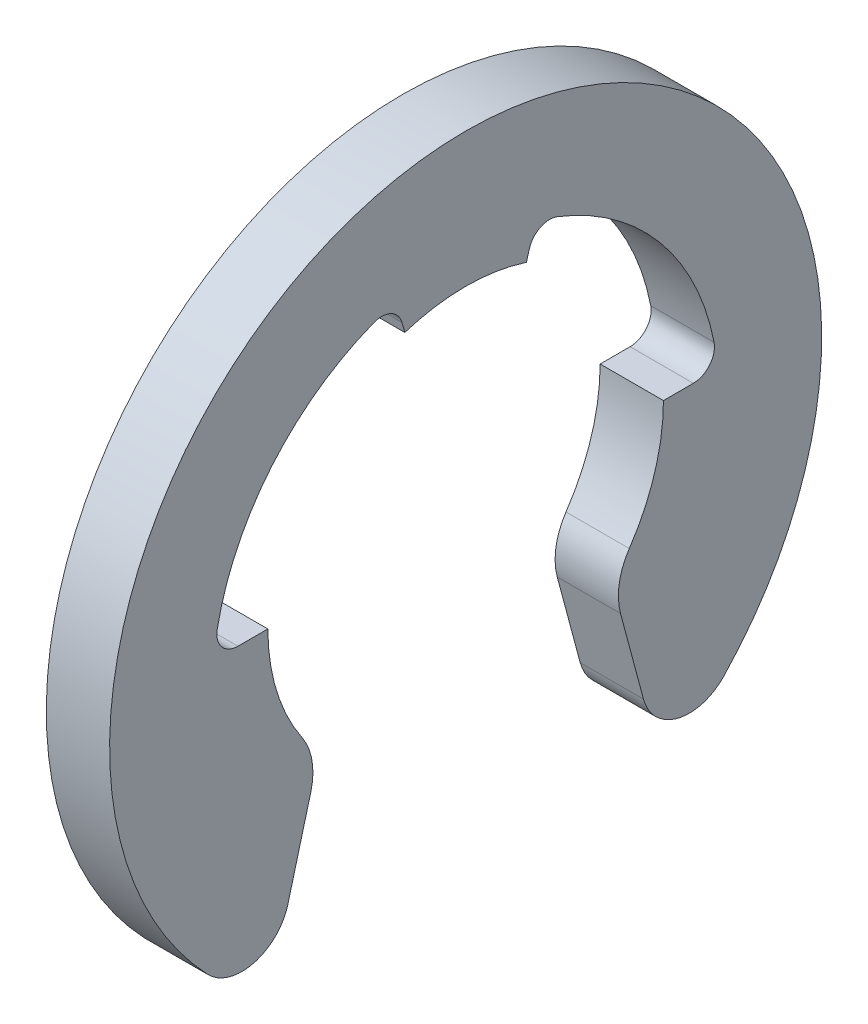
ISO-10303-21;
HEADER;
FILE_DESCRIPTION(('STEP AP214'),'2;1');
FILE_NAME('part.step','',(''),(''),'','','');
FILE_SCHEMA(('AUTOMOTIVE_DESIGN { 1 0 10303 214 1 1 1 1 }'));
ENDSEC;
DATA;
#1=APPLICATION_CONTEXT('core data for automotive mechanical design processes');
#2=APPLICATION_PROTOCOL_DEFINITION('international standard','automotive_design',2000,#1);
#3=PRODUCT_CONTEXT('',#1,'mechanical');
#4=PRODUCT('Part','Part','',(#3));
#5=PRODUCT_RELATED_PRODUCT_CATEGORY('part','',(#4));
#6=PRODUCT_DEFINITION_FORMATION('','',#4);
#7=PRODUCT_DEFINITION_CONTEXT('part definition',#1,'design');
#8=PRODUCT_DEFINITION('design','',#6,#7);
#9=PRODUCT_DEFINITION_SHAPE('','',#8);
#10=(LENGTH_UNIT() NAMED_UNIT(*) SI_UNIT(.MILLI.,.METRE.));
#11=(NAMED_UNIT(*) PLANE_ANGLE_UNIT() SI_UNIT($,.RADIAN.));
#12=(NAMED_UNIT(*) SI_UNIT($,.STERADIAN.) SOLID_ANGLE_UNIT());
#13=UNCERTAINTY_MEASURE_WITH_UNIT(LENGTH_MEASURE(1.E-05),#10,'distance_accuracy_value','');
#14=(GEOMETRIC_REPRESENTATION_CONTEXT(3) GLOBAL_UNCERTAINTY_ASSIGNED_CONTEXT((#13)) GLOBAL_UNIT_ASSIGNED_CONTEXT((#10,
#11,#12)) REPRESENTATION_CONTEXT('',''));
#15=CARTESIAN_POINT('',(0.,0.,0.));
#16=DIRECTION('',(0.,0.,1.));
#17=DIRECTION('',(1.,0.,0.));
#18=AXIS2_PLACEMENT_3D('',#15,#16,#17);
#19=CARTESIAN_POINT('',(0.4,0.283333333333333,-1.43903903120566));
#20=DIRECTION('',(-1.,0.,0.));
#21=DIRECTION('',(0.,0.,1.));
#22=AXIS2_PLACEMENT_3D('',#19,#20,#21);
#23=CYLINDRICAL_SURFACE('',#22,0.133333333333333);
#24=CARTESIAN_POINT('',(0.,0.283333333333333,-1.43903903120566));
#25=DIRECTION('',(-1.,0.,0.));
#26=DIRECTION('',(0.,0.,1.));
#27=AXIS2_PLACEMENT_3D('',#24,#25,#26);
#28=CIRCLE('',#27,0.133333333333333);
#29=CARTESIAN_POINT('',(0.,0.309090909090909,-1.56986076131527));
#30=VERTEX_POINT('',#29);
#31=CARTESIAN_POINT('',(0.,0.15,-1.43903903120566));
#32=VERTEX_POINT('',#31);
#33=EDGE_CURVE('E175',#30,#32,#28,.T.);
#34=ORIENTED_EDGE('',*,*,#33,.T.);
#35=DIRECTION('',(-1.,0.,0.));
#36=VECTOR('',#35,1.);
#37=CARTESIAN_POINT('',(0.4,0.15,-1.43903903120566));
#38=LINE('',#37,#36);
#39=CARTESIAN_POINT('',(0.4,0.15,-1.43903903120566));
#40=VERTEX_POINT('',#39);
#41=EDGE_CURVE('E11',#40,#32,#38,.T.);
#42=ORIENTED_EDGE('',*,*,#41,.F.);
#43=CARTESIAN_POINT('',(0.4,0.283333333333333,-1.43903903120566));
#44=DIRECTION('',(-1.,0.,0.));
#45=DIRECTION('',(0.,0.,1.));
#46=AXIS2_PLACEMENT_3D('',#43,#44,#45);
#47=CIRCLE('',#46,0.133333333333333);
#48=CARTESIAN_POINT('',(0.4,0.309090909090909,-1.56986076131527));
#49=VERTEX_POINT('',#48);
#50=EDGE_CURVE('E234',#49,#40,#47,.T.);
#51=ORIENTED_EDGE('',*,*,#50,.F.);
#52=DIRECTION('',(-1.,0.,0.));
#53=VECTOR('',#52,1.);
#54=CARTESIAN_POINT('',(0.4,0.309090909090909,-1.56986076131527));
#55=LINE('',#54,#53);
#56=EDGE_CURVE('E43',#49,#30,#55,.T.);
#57=ORIENTED_EDGE('',*,*,#56,.T.);
#58=EDGE_LOOP('',(#34,#42,#51,#57));
#59=FACE_BOUND('',#58,.T.);
#60=ADVANCED_FACE('F29',(#59),#23,.F.);
#61=CARTESIAN_POINT('',(0.4,0.15,-1.25));
#62=DIRECTION('',(0.,1.,0.));
#63=DIRECTION('',(0.,0.,1.));
#64=AXIS2_PLACEMENT_3D('',#61,#62,#63);
#65=PLANE('',#64);
#66=DIRECTION('',(0.,0.,-1.));
#67=VECTOR('',#66,1.);
#68=CARTESIAN_POINT('',(0.,0.15,-1.25));
#69=LINE('',#68,#67);
#70=CARTESIAN_POINT('',(0.,0.15,-1.25));
#71=VERTEX_POINT('',#70);
#72=EDGE_CURVE('E170',#71,#32,#69,.T.);
#73=ORIENTED_EDGE('',*,*,#72,.F.);
#74=DIRECTION('',(-1.,0.,0.));
#75=VECTOR('',#74,1.);
#76=CARTESIAN_POINT('',(0.4,0.15,-1.25));
#77=LINE('',#76,#75);
#78=CARTESIAN_POINT('',(0.4,0.15,-1.25));
#79=VERTEX_POINT('',#78);
#80=EDGE_CURVE('E36',#79,#71,#77,.T.);
#81=ORIENTED_EDGE('',*,*,#80,.F.);
#82=DIRECTION('',(0.,0.,-1.));
#83=VECTOR('',#82,1.);
#84=CARTESIAN_POINT('',(0.4,0.15,-1.25));
#85=LINE('',#84,#83);
#86=EDGE_CURVE('E172',#79,#40,#85,.T.);
#87=ORIENTED_EDGE('',*,*,#86,.T.);
#88=ORIENTED_EDGE('',*,*,#41,.T.);
#89=EDGE_LOOP('',(#73,#81,#87,#88));
#90=FACE_BOUND('',#89,.T.);
#91=ADVANCED_FACE('F168',(#90),#65,.T.);
#92=CARTESIAN_POINT('',(0.4,0.15,0.));
#93=DIRECTION('',(-1.,0.,0.));
#94=DIRECTION('',(0.,0.,1.));
#95=AXIS2_PLACEMENT_3D('',#92,#93,#94);
#96=CYLINDRICAL_SURFACE('',#95,1.25);
#97=CARTESIAN_POINT('',(0.,0.15,0.));
#98=DIRECTION('',(-1.,0.,0.));
#99=DIRECTION('',(0.,0.,1.));
#100=AXIS2_PLACEMENT_3D('',#97,#98,#99);
#101=CIRCLE('',#100,1.25);
#102=CARTESIAN_POINT('',(0.,-0.551990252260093,-1.03426770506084));
#103=VERTEX_POINT('',#102);
#104=EDGE_CURVE('E183',#71,#103,#101,.T.);
#105=ORIENTED_EDGE('',*,*,#104,.T.);
#106=DIRECTION('',(-1.,0.,0.));
#107=VECTOR('',#106,1.);
#108=CARTESIAN_POINT('',(0.4,-0.551990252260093,-1.03426770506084));
#109=LINE('',#108,#107);
#110=CARTESIAN_POINT('',(0.4,-0.551990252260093,-1.03426770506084));
#111=VERTEX_POINT('',#110);
#112=EDGE_CURVE('E314',#111,#103,#109,.T.);
#113=ORIENTED_EDGE('',*,*,#112,.F.);
#114=CARTESIAN_POINT('',(0.4,0.15,0.));
#115=DIRECTION('',(-1.,0.,0.));
#116=DIRECTION('',(0.,0.,1.));
#117=AXIS2_PLACEMENT_3D('',#114,#115,#116);
#118=CIRCLE('',#117,1.25);
#119=EDGE_CURVE('E237',#79,#111,#118,.T.);
#120=ORIENTED_EDGE('',*,*,#119,.F.);
#121=ORIENTED_EDGE('',*,*,#80,.T.);
#122=EDGE_LOOP('',(#105,#113,#120,#121));
#123=FACE_BOUND('',#122,.T.);
#124=ADVANCED_FACE('F317',(#123),#96,.F.);
#125=CARTESIAN_POINT('',(0.4,-0.776627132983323,-1.3652333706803));
#126=DIRECTION('',(-1.,0.,0.));
#127=DIRECTION('',(0.,0.,1.));
#128=AXIS2_PLACEMENT_3D('',#125,#126,#127);
#129=CYLINDRICAL_SURFACE('',#128,0.4);
#130=CARTESIAN_POINT('',(0.,-0.776627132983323,-1.3652333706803));
#131=DIRECTION('',(-1.,0.,0.));
#132=DIRECTION('',(0.,0.,1.));
#133=AXIS2_PLACEMENT_3D('',#130,#131,#132);
#134=CIRCLE('',#133,0.4);
#135=CARTESIAN_POINT('',(0.,-0.880154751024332,-0.978863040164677));
#136=VERTEX_POINT('',#135);
#137=EDGE_CURVE('E185',#136,#103,#134,.T.);
#138=ORIENTED_EDGE('',*,*,#137,.F.);
#139=DIRECTION('',(-1.,0.,0.));
#140=VECTOR('',#139,1.);
#141=CARTESIAN_POINT('',(0.4,-0.880154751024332,-0.978863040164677));
#142=LINE('',#141,#140);
#143=CARTESIAN_POINT('',(0.4,-0.880154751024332,-0.978863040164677));
#144=VERTEX_POINT('',#143);
#145=EDGE_CURVE('E312',#144,#136,#142,.T.);
#146=ORIENTED_EDGE('',*,*,#145,.F.);
#147=CARTESIAN_POINT('',(0.4,-0.776627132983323,-1.3652333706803));
#148=DIRECTION('',(-1.,0.,0.));
#149=DIRECTION('',(0.,0.,1.));
#150=AXIS2_PLACEMENT_3D('',#147,#148,#149);
#151=CIRCLE('',#150,0.4);
#152=EDGE_CURVE('E239',#144,#111,#151,.T.);
#153=ORIENTED_EDGE('',*,*,#152,.T.);
#154=ORIENTED_EDGE('',*,*,#112,.T.);
#155=EDGE_LOOP('',(#138,#146,#153,#154));
#156=FACE_BOUND('',#155,.T.);
#157=ADVANCED_FACE('F388',(#156),#129,.T.);
#158=CARTESIAN_POINT('',(0.4,-0.880154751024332,-0.978863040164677));
#159=DIRECTION('',(0.,0.258819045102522,-0.965925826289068));
#160=DIRECTION('',(0.,0.965925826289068,0.258819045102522));
#161=AXIS2_PLACEMENT_3D('',#158,#159,#160);
#162=PLANE('',#161);
#163=DIRECTION('',(0.,-0.965925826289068,-0.258819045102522));
#164=VECTOR('',#163,1.);
#165=CARTESIAN_POINT('',(0.,-0.880154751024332,-0.978863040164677));
#166=LINE('',#165,#164);
#167=CARTESIAN_POINT('',(0.,-1.42092678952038,-1.12376247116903));
#168=VERTEX_POINT('',#167);
#169=EDGE_CURVE('E189',#136,#168,#166,.T.);
#170=ORIENTED_EDGE('',*,*,#169,.T.);
#171=DIRECTION('',(-1.,0.,0.));
#172=VECTOR('',#171,1.);
#173=CARTESIAN_POINT('',(0.4,-1.42092678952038,-1.12376247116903));
#174=LINE('',#173,#172);
#175=CARTESIAN_POINT('',(0.4,-1.42092678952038,-1.12376247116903));
#176=VERTEX_POINT('',#175);
#177=EDGE_CURVE('E310',#176,#168,#174,.T.);
#178=ORIENTED_EDGE('',*,*,#177,.F.);
#179=DIRECTION('',(0.,-0.965925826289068,-0.258819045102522));
#180=VECTOR('',#179,1.);
#181=CARTESIAN_POINT('',(0.4,-0.880154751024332,-0.978863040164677));
#182=LINE('',#181,#180);
#183=EDGE_CURVE('E242',#144,#176,#182,.T.);
#184=ORIENTED_EDGE('',*,*,#183,.F.);
#185=ORIENTED_EDGE('',*,*,#145,.T.);
#186=EDGE_LOOP('',(#170,#178,#184,#185));
#187=FACE_BOUND('',#186,.T.);
#188=ADVANCED_FACE('F385',(#187),#162,.F.);
#189=CARTESIAN_POINT('',(0.4,-1.34328107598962,-1.41354021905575));
#190=DIRECTION('',(-1.,0.,0.));
#191=DIRECTION('',(0.,0.,1.));
#192=AXIS2_PLACEMENT_3D('',#189,#190,#191);
#193=CYLINDRICAL_SURFACE('',#192,0.3);
#194=CARTESIAN_POINT('',(0.,-1.34328107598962,-1.41354021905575));
#195=DIRECTION('',(-1.,0.,0.));
#196=DIRECTION('',(0.,0.,1.));
#197=AXIS2_PLACEMENT_3D('',#194,#195,#196);
#198=CIRCLE('',#197,0.3);
#199=CARTESIAN_POINT('',(0.,-1.54993970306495,-1.63100794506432));
#200=VERTEX_POINT('',#199);
#201=EDGE_CURVE('E192',#200,#168,#198,.T.);
#202=ORIENTED_EDGE('',*,*,#201,.F.);
#203=DIRECTION('',(-1.,0.,0.));
#204=VECTOR('',#203,1.);
#205=CARTESIAN_POINT('',(0.4,-1.54993970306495,-1.63100794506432));
#206=LINE('',#205,#204);
#207=CARTESIAN_POINT('',(0.4,-1.54993970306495,-1.63100794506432));
#208=VERTEX_POINT('',#207);
#209=EDGE_CURVE('E308',#208,#200,#206,.T.);
#210=ORIENTED_EDGE('',*,*,#209,.F.);
#211=CARTESIAN_POINT('',(0.4,-1.34328107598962,-1.41354021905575));
#212=DIRECTION('',(-1.,0.,0.));
#213=DIRECTION('',(0.,0.,1.));
#214=AXIS2_PLACEMENT_3D('',#211,#212,#213);
#215=CIRCLE('',#214,0.3);
#216=EDGE_CURVE('E244',#208,#176,#215,.T.);
#217=ORIENTED_EDGE('',*,*,#216,.T.);
#218=ORIENTED_EDGE('',*,*,#177,.T.);
#219=EDGE_LOOP('',(#202,#210,#217,#218));
#220=FACE_BOUND('',#219,.T.);
#221=ADVANCED_FACE('F379',(#220),#193,.T.);
#222=CARTESIAN_POINT('',(0.4,0.,0.));
#223=DIRECTION('',(-1.,0.,0.));
#224=DIRECTION('',(0.,0.,1.));
#225=AXIS2_PLACEMENT_3D('',#222,#223,#224);
#226=CYLINDRICAL_SURFACE('',#225,2.25);
#227=CARTESIAN_POINT('',(0.,0.,0.));
#228=DIRECTION('',(1.,0.,0.));
#229=DIRECTION('',(0.,0.,-1.));
#230=AXIS2_PLACEMENT_3D('',#227,#228,#229);
#231=CIRCLE('',#230,2.25);
#232=CARTESIAN_POINT('',(0.,-1.54993970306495,1.63100794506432));
#233=VERTEX_POINT('',#232);
#234=EDGE_CURVE('E195',#200,#233,#231,.T.);
#235=ORIENTED_EDGE('',*,*,#234,.T.);
#236=DIRECTION('',(-1.,0.,0.));
#237=VECTOR('',#236,1.);
#238=CARTESIAN_POINT('',(0.4,-1.54993970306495,1.63100794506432));
#239=LINE('',#238,#237);
#240=CARTESIAN_POINT('',(0.4,-1.54993970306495,1.63100794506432));
#241=VERTEX_POINT('',#240);
#242=EDGE_CURVE('E305',#241,#233,#239,.T.);
#243=ORIENTED_EDGE('',*,*,#242,.F.);
#244=CARTESIAN_POINT('',(0.4,0.,0.));
#245=DIRECTION('',(1.,0.,0.));
#246=DIRECTION('',(0.,0.,-1.));
#247=AXIS2_PLACEMENT_3D('',#244,#245,#246);
#248=CIRCLE('',#247,2.25);
#249=EDGE_CURVE('E247',#208,#241,#248,.T.);
#250=ORIENTED_EDGE('',*,*,#249,.F.);
#251=ORIENTED_EDGE('',*,*,#209,.T.);
#252=EDGE_LOOP('',(#235,#243,#250,#251));
#253=FACE_BOUND('',#252,.T.);
#254=ADVANCED_FACE('F389',(#253),#226,.T.);
#255=CARTESIAN_POINT('',(0.4,-1.34328107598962,1.41354021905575));
#256=DIRECTION('',(-1.,0.,0.));
#257=DIRECTION('',(0.,0.,1.));
#258=AXIS2_PLACEMENT_3D('',#255,#256,#257);
#259=CYLINDRICAL_SURFACE('',#258,0.3);
#260=CARTESIAN_POINT('',(0.,-1.34328107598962,1.41354021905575));
#261=DIRECTION('',(1.,0.,0.));
#262=DIRECTION('',(0.,0.,-1.));
#263=AXIS2_PLACEMENT_3D('',#260,#261,#262);
#264=CIRCLE('',#263,0.3);
#265=CARTESIAN_POINT('',(0.,-1.42092678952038,1.12376247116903));
#266=VERTEX_POINT('',#265);
#267=EDGE_CURVE('E197',#233,#266,#264,.T.);
#268=ORIENTED_EDGE('',*,*,#267,.T.);
#269=DIRECTION('',(-1.,0.,0.));
#270=VECTOR('',#269,1.);
#271=CARTESIAN_POINT('',(0.4,-1.42092678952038,1.12376247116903));
#272=LINE('',#271,#270);
#273=CARTESIAN_POINT('',(0.4,-1.42092678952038,1.12376247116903));
#274=VERTEX_POINT('',#273);
#275=EDGE_CURVE('E303',#274,#266,#272,.T.);
#276=ORIENTED_EDGE('',*,*,#275,.F.);
#277=CARTESIAN_POINT('',(0.4,-1.34328107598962,1.41354021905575));
#278=DIRECTION('',(1.,0.,0.));
#279=DIRECTION('',(0.,0.,-1.));
#280=AXIS2_PLACEMENT_3D('',#277,#278,#279);
#281=CIRCLE('',#280,0.3);
#282=EDGE_CURVE('E249',#241,#274,#281,.T.);
#283=ORIENTED_EDGE('',*,*,#282,.F.);
#284=ORIENTED_EDGE('',*,*,#242,.T.);
#285=EDGE_LOOP('',(#268,#276,#283,#284));
#286=FACE_BOUND('',#285,.T.);
#287=ADVANCED_FACE('F372',(#286),#259,.T.);
#288=CARTESIAN_POINT('',(0.4,-0.880154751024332,0.978863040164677));
#289=DIRECTION('',(0.,-0.258819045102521,-0.965925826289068));
#290=DIRECTION('',(0.,0.965925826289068,-0.258819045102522));
#291=AXIS2_PLACEMENT_3D('',#288,#289,#290);
#292=PLANE('',#291);
#293=DIRECTION('',(0.,-0.965925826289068,0.258819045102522));
#294=VECTOR('',#293,1.);
#295=CARTESIAN_POINT('',(0.,-0.880154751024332,0.978863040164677));
#296=LINE('',#295,#294);
#297=CARTESIAN_POINT('',(0.,-0.880154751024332,0.978863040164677));
#298=VERTEX_POINT('',#297);
#299=EDGE_CURVE('E200',#298,#266,#296,.T.);
#300=ORIENTED_EDGE('',*,*,#299,.F.);
#301=DIRECTION('',(-1.,0.,0.));
#302=VECTOR('',#301,1.);
#303=CARTESIAN_POINT('',(0.4,-0.880154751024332,0.978863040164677));
#304=LINE('',#303,#302);
#305=CARTESIAN_POINT('',(0.4,-0.880154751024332,0.978863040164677));
#306=VERTEX_POINT('',#305);
#307=EDGE_CURVE('E301',#306,#298,#304,.T.);
#308=ORIENTED_EDGE('',*,*,#307,.F.);
#309=DIRECTION('',(0.,-0.965925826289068,0.258819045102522));
#310=VECTOR('',#309,1.);
#311=CARTESIAN_POINT('',(0.4,-0.880154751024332,0.978863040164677));
#312=LINE('',#311,#310);
#313=EDGE_CURVE('E251',#306,#274,#312,.T.);
#314=ORIENTED_EDGE('',*,*,#313,.T.);
#315=ORIENTED_EDGE('',*,*,#275,.T.);
#316=EDGE_LOOP('',(#300,#308,#314,#315));
#317=FACE_BOUND('',#316,.T.);
#318=ADVANCED_FACE('F367',(#317),#292,.T.);
#319=CARTESIAN_POINT('',(0.4,-0.776627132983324,1.3652333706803));
#320=DIRECTION('',(-1.,0.,0.));
#321=DIRECTION('',(0.,0.,1.));
#322=AXIS2_PLACEMENT_3D('',#319,#320,#321);
#323=CYLINDRICAL_SURFACE('',#322,0.4);
#324=CARTESIAN_POINT('',(0.,-0.776627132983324,1.3652333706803));
#325=DIRECTION('',(1.,0.,0.));
#326=DIRECTION('',(0.,0.,-1.));
#327=AXIS2_PLACEMENT_3D('',#324,#325,#326);
#328=CIRCLE('',#327,0.4);
#329=CARTESIAN_POINT('',(0.,-0.551990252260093,1.03426770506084));
#330=VERTEX_POINT('',#329);
#331=EDGE_CURVE('E203',#298,#330,#328,.T.);
#332=ORIENTED_EDGE('',*,*,#331,.T.);
#333=DIRECTION('',(-1.,0.,0.));
#334=VECTOR('',#333,1.);
#335=CARTESIAN_POINT('',(0.4,-0.551990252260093,1.03426770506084));
#336=LINE('',#335,#334);
#337=CARTESIAN_POINT('',(0.4,-0.551990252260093,1.03426770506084));
#338=VERTEX_POINT('',#337);
#339=EDGE_CURVE('E299',#338,#330,#336,.T.);
#340=ORIENTED_EDGE('',*,*,#339,.F.);
#341=CARTESIAN_POINT('',(0.4,-0.776627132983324,1.3652333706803));
#342=DIRECTION('',(1.,0.,0.));
#343=DIRECTION('',(0.,0.,-1.));
#344=AXIS2_PLACEMENT_3D('',#341,#342,#343);
#345=CIRCLE('',#344,0.4);
#346=EDGE_CURVE('E254',#306,#338,#345,.T.);
#347=ORIENTED_EDGE('',*,*,#346,.F.);
#348=ORIENTED_EDGE('',*,*,#307,.T.);
#349=EDGE_LOOP('',(#332,#340,#347,#348));
#350=FACE_BOUND('',#349,.T.);
#351=ADVANCED_FACE('F363',(#350),#323,.T.);
#352=CARTESIAN_POINT('',(0.4,0.15,0.));
#353=DIRECTION('',(-1.,0.,0.));
#354=DIRECTION('',(0.,0.,1.));
#355=AXIS2_PLACEMENT_3D('',#352,#353,#354);
#356=CYLINDRICAL_SURFACE('',#355,1.25);
#357=CARTESIAN_POINT('',(0.,0.15,0.));
#358=DIRECTION('',(1.,0.,0.));
#359=DIRECTION('',(0.,0.,-1.));
#360=AXIS2_PLACEMENT_3D('',#357,#358,#359);
#361=CIRCLE('',#360,1.25);
#362=CARTESIAN_POINT('',(0.,0.15,1.25));
#363=VERTEX_POINT('',#362);
#364=EDGE_CURVE('E206',#363,#330,#361,.T.);
#365=ORIENTED_EDGE('',*,*,#364,.F.);
#366=DIRECTION('',(-1.,0.,0.));
#367=VECTOR('',#366,1.);
#368=CARTESIAN_POINT('',(0.4,0.15,1.25));
#369=LINE('',#368,#367);
#370=CARTESIAN_POINT('',(0.4,0.15,1.25));
#371=VERTEX_POINT('',#370);
#372=EDGE_CURVE('E297',#371,#363,#369,.T.);
#373=ORIENTED_EDGE('',*,*,#372,.F.);
#374=CARTESIAN_POINT('',(0.4,0.15,0.));
#375=DIRECTION('',(1.,0.,0.));
#376=DIRECTION('',(0.,0.,-1.));
#377=AXIS2_PLACEMENT_3D('',#374,#375,#376);
#378=CIRCLE('',#377,1.25);
#379=EDGE_CURVE('E256',#371,#338,#378,.T.);
#380=ORIENTED_EDGE('',*,*,#379,.T.);
#381=ORIENTED_EDGE('',*,*,#339,.T.);
#382=EDGE_LOOP('',(#365,#373,#380,#381));
#383=FACE_BOUND('',#382,.T.);
#384=ADVANCED_FACE('F357',(#383),#356,.F.);
#385=CARTESIAN_POINT('',(0.4,0.15,1.25));
#386=DIRECTION('',(0.,-1.,0.));
#387=DIRECTION('',(0.,0.,-1.));
#388=AXIS2_PLACEMENT_3D('',#385,#386,#387);
#389=PLANE('',#388);
#390=DIRECTION('',(0.,0.,1.));
#391=VECTOR('',#390,1.);
#392=CARTESIAN_POINT('',(0.,0.15,1.25));
#393=LINE('',#392,#391);
#394=CARTESIAN_POINT('',(0.,0.15,1.43903903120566));
#395=VERTEX_POINT('',#394);
#396=EDGE_CURVE('E209',#363,#395,#393,.T.);
#397=ORIENTED_EDGE('',*,*,#396,.T.);
#398=DIRECTION('',(-1.,0.,0.));
#399=VECTOR('',#398,1.);
#400=CARTESIAN_POINT('',(0.4,0.15,1.43903903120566));
#401=LINE('',#400,#399);
#402=CARTESIAN_POINT('',(0.4,0.15,1.43903903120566));
#403=VERTEX_POINT('',#402);
#404=EDGE_CURVE('E295',#403,#395,#401,.T.);
#405=ORIENTED_EDGE('',*,*,#404,.F.);
#406=DIRECTION('',(0.,0.,1.));
#407=VECTOR('',#406,1.);
#408=CARTESIAN_POINT('',(0.4,0.15,1.25));
#409=LINE('',#408,#407);
#410=EDGE_CURVE('E259',#371,#403,#409,.T.);
#411=ORIENTED_EDGE('',*,*,#410,.F.);
#412=ORIENTED_EDGE('',*,*,#372,.T.);
#413=EDGE_LOOP('',(#397,#405,#411,#412));
#414=FACE_BOUND('',#413,.T.);
#415=ADVANCED_FACE('F453',(#414),#389,.F.);
#416=CARTESIAN_POINT('',(0.4,0.283333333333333,1.43903903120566));
#417=DIRECTION('',(-1.,0.,0.));
#418=DIRECTION('',(0.,0.,1.));
#419=AXIS2_PLACEMENT_3D('',#416,#417,#418);
#420=CYLINDRICAL_SURFACE('',#419,0.133333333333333);
#421=CARTESIAN_POINT('',(0.,0.283333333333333,1.43903903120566));
#422=DIRECTION('',(1.,0.,0.));
#423=DIRECTION('',(0.,0.,-1.));
#424=AXIS2_PLACEMENT_3D('',#421,#422,#423);
#425=CIRCLE('',#424,0.133333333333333);
#426=CARTESIAN_POINT('',(0.,0.309090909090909,1.56986076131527));
#427=VERTEX_POINT('',#426);
#428=EDGE_CURVE('E212',#427,#395,#425,.T.);
#429=ORIENTED_EDGE('',*,*,#428,.F.);
#430=DIRECTION('',(-1.,0.,0.));
#431=VECTOR('',#430,1.);
#432=CARTESIAN_POINT('',(0.4,0.309090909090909,1.56986076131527));
#433=LINE('',#432,#431);
#434=CARTESIAN_POINT('',(0.4,0.309090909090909,1.56986076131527));
#435=VERTEX_POINT('',#434);
#436=EDGE_CURVE('E293',#435,#427,#433,.T.);
#437=ORIENTED_EDGE('',*,*,#436,.F.);
#438=CARTESIAN_POINT('',(0.4,0.283333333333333,1.43903903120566));
#439=DIRECTION('',(1.,0.,0.));
#440=DIRECTION('',(0.,0.,-1.));
#441=AXIS2_PLACEMENT_3D('',#438,#439,#440);
#442=CIRCLE('',#441,0.133333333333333);
#443=EDGE_CURVE('E261',#435,#403,#442,.T.);
#444=ORIENTED_EDGE('',*,*,#443,.T.);
#445=ORIENTED_EDGE('',*,*,#404,.T.);
#446=EDGE_LOOP('',(#429,#437,#444,#445));
#447=FACE_BOUND('',#446,.T.);
#448=ADVANCED_FACE('F350',(#447),#420,.F.);
#449=CARTESIAN_POINT('',(0.4,0.,0.));
#450=DIRECTION('',(-1.,0.,0.));
#451=DIRECTION('',(0.,0.,1.));
#452=AXIS2_PLACEMENT_3D('',#449,#450,#451);
#453=CYLINDRICAL_SURFACE('',#452,1.6);
#454=CARTESIAN_POINT('',(0.,0.,0.));
#455=DIRECTION('',(-1.,0.,0.));
#456=DIRECTION('',(0.,0.,1.));
#457=AXIS2_PLACEMENT_3D('',#454,#455,#456);
#458=CIRCLE('',#457,1.6);
#459=CARTESIAN_POINT('',(0.,1.49155737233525,0.579013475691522));
#460=VERTEX_POINT('',#459);
#461=EDGE_CURVE('E215',#427,#460,#458,.T.);
#462=ORIENTED_EDGE('',*,*,#461,.T.);
#463=DIRECTION('',(-1.,0.,0.));
#464=VECTOR('',#463,1.);
#465=CARTESIAN_POINT('',(0.4,1.49155737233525,0.579013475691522));
#466=LINE('',#465,#464);
#467=CARTESIAN_POINT('',(0.4,1.49155737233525,0.579013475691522));
#468=VERTEX_POINT('',#467);
#469=EDGE_CURVE('E290',#468,#460,#466,.T.);
#470=ORIENTED_EDGE('',*,*,#469,.F.);
#471=CARTESIAN_POINT('',(0.4,0.,0.));
#472=DIRECTION('',(-1.,0.,0.));
#473=DIRECTION('',(0.,0.,1.));
#474=AXIS2_PLACEMENT_3D('',#471,#472,#473);
#475=CIRCLE('',#474,1.6);
#476=EDGE_CURVE('E264',#435,#468,#475,.T.);
#477=ORIENTED_EDGE('',*,*,#476,.F.);
#478=ORIENTED_EDGE('',*,*,#436,.T.);
#479=EDGE_LOOP('',(#462,#470,#477,#478));
#480=FACE_BOUND('',#479,.T.);
#481=ADVANCED_FACE('F347',(#480),#453,.F.);
#482=CARTESIAN_POINT('',(0.4,1.36726092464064,0.530762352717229));
#483=DIRECTION('',(-1.,0.,0.));
#484=DIRECTION('',(0.,0.,1.));
#485=AXIS2_PLACEMENT_3D('',#482,#483,#484);
#486=CYLINDRICAL_SURFACE('',#485,0.133333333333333);
#487=CARTESIAN_POINT('',(0.,1.36726092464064,0.530762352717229));
#488=DIRECTION('',(-1.,0.,0.));
#489=DIRECTION('',(0.,0.,1.));
#490=AXIS2_PLACEMENT_3D('',#487,#488,#489);
#491=CIRCLE('',#490,0.133333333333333);
#492=CARTESIAN_POINT('',(0.,1.40401257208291,0.402594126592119));
#493=VERTEX_POINT('',#492);
#494=EDGE_CURVE('E217',#460,#493,#491,.T.);
#495=ORIENTED_EDGE('',*,*,#494,.T.);
#496=DIRECTION('',(-1.,0.,0.));
#497=VECTOR('',#496,1.);
#498=CARTESIAN_POINT('',(0.4,1.40401257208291,0.402594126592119));
#499=LINE('',#498,#497);
#500=CARTESIAN_POINT('',(0.4,1.40401257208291,0.402594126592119));
#501=VERTEX_POINT('',#500);
#502=EDGE_CURVE('E288',#501,#493,#499,.T.);
#503=ORIENTED_EDGE('',*,*,#502,.F.);
#504=CARTESIAN_POINT('',(0.4,1.36726092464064,0.530762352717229));
#505=DIRECTION('',(-1.,0.,0.));
#506=DIRECTION('',(0.,0.,1.));
#507=AXIS2_PLACEMENT_3D('',#504,#505,#506);
#508=CIRCLE('',#507,0.133333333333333);
#509=EDGE_CURVE('E266',#468,#501,#508,.T.);
#510=ORIENTED_EDGE('',*,*,#509,.F.);
#511=ORIENTED_EDGE('',*,*,#469,.T.);
#512=EDGE_LOOP('',(#495,#503,#510,#511));
#513=FACE_BOUND('',#512,.T.);
#514=ADVANCED_FACE('F342',(#513),#486,.F.);
#515=CARTESIAN_POINT('',(0.4,1.33952325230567,0.384102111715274));
#516=DIRECTION('',(0.,-0.275637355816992,0.961261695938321));
#517=DIRECTION('',(0.,-0.961261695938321,-0.275637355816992));
#518=AXIS2_PLACEMENT_3D('',#515,#516,#517);
#519=PLANE('',#518);
#520=DIRECTION('',(0.,0.961261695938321,0.275637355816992));
#521=VECTOR('',#520,1.);
#522=CARTESIAN_POINT('',(0.,1.33952325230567,0.384102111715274));
#523=LINE('',#522,#521);
#524=CARTESIAN_POINT('',(0.,1.33952325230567,0.384102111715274));
#525=VERTEX_POINT('',#524);
#526=EDGE_CURVE('E220',#525,#493,#523,.T.);
#527=ORIENTED_EDGE('',*,*,#526,.F.);
#528=DIRECTION('',(-1.,0.,0.));
#529=VECTOR('',#528,1.);
#530=CARTESIAN_POINT('',(0.4,1.33952325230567,0.384102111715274));
#531=LINE('',#530,#529);
#532=CARTESIAN_POINT('',(0.4,1.33952325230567,0.384102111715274));
#533=VERTEX_POINT('',#532);
#534=EDGE_CURVE('E286',#533,#525,#531,.T.);
#535=ORIENTED_EDGE('',*,*,#534,.F.);
#536=DIRECTION('',(0.,0.961261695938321,0.275637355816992));
#537=VECTOR('',#536,1.);
#538=CARTESIAN_POINT('',(0.4,1.33952325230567,0.384102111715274));
#539=LINE('',#538,#537);
#540=EDGE_CURVE('E268',#533,#501,#539,.T.);
#541=ORIENTED_EDGE('',*,*,#540,.T.);
#542=ORIENTED_EDGE('',*,*,#502,.T.);
#543=EDGE_LOOP('',(#527,#535,#541,#542));
#544=FACE_BOUND('',#543,.T.);
#545=ADVANCED_FACE('F336',(#544),#519,.T.);
#546=CARTESIAN_POINT('',(0.4,0.15,0.));
#547=DIRECTION('',(-1.,0.,0.));
#548=DIRECTION('',(0.,0.,1.));
#549=AXIS2_PLACEMENT_3D('',#546,#547,#548);
#550=CYLINDRICAL_SURFACE('',#549,1.25);
#551=CARTESIAN_POINT('',(0.,0.15,0.));
#552=DIRECTION('',(1.,0.,0.));
#553=DIRECTION('',(0.,0.,-1.));
#554=AXIS2_PLACEMENT_3D('',#551,#552,#553);
#555=CIRCLE('',#554,1.25);
#556=CARTESIAN_POINT('',(0.,1.33952325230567,-0.384102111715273));
#557=VERTEX_POINT('',#556);
#558=EDGE_CURVE('E223',#557,#525,#555,.T.);
#559=ORIENTED_EDGE('',*,*,#558,.F.);
#560=DIRECTION('',(-1.,0.,0.));
#561=VECTOR('',#560,1.);
#562=CARTESIAN_POINT('',(0.4,1.33952325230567,-0.384102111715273));
#563=LINE('',#562,#561);
#564=CARTESIAN_POINT('',(0.4,1.33952325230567,-0.384102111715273));
#565=VERTEX_POINT('',#564);
#566=EDGE_CURVE('E284',#565,#557,#563,.T.);
#567=ORIENTED_EDGE('',*,*,#566,.F.);
#568=CARTESIAN_POINT('',(0.4,0.15,0.));
#569=DIRECTION('',(1.,0.,0.));
#570=DIRECTION('',(0.,0.,-1.));
#571=AXIS2_PLACEMENT_3D('',#568,#569,#570);
#572=CIRCLE('',#571,1.25);
#573=EDGE_CURVE('E271',#565,#533,#572,.T.);
#574=ORIENTED_EDGE('',*,*,#573,.T.);
#575=ORIENTED_EDGE('',*,*,#534,.T.);
#576=EDGE_LOOP('',(#559,#567,#574,#575));
#577=FACE_BOUND('',#576,.T.);
#578=ADVANCED_FACE('F330',(#577),#550,.F.);
#579=CARTESIAN_POINT('',(0.4,1.33952325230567,-0.384102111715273));
#580=DIRECTION('',(0.,0.275637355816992,0.961261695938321));
#581=DIRECTION('',(0.,-0.961261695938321,0.275637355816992));
#582=AXIS2_PLACEMENT_3D('',#579,#580,#581);
#583=PLANE('',#582);
#584=DIRECTION('',(0.,0.961261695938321,-0.275637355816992));
#585=VECTOR('',#584,1.);
#586=CARTESIAN_POINT('',(0.,1.33952325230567,-0.384102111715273));
#587=LINE('',#586,#585);
#588=CARTESIAN_POINT('',(0.,1.40401257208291,-0.402594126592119));
#589=VERTEX_POINT('',#588);
#590=EDGE_CURVE('E226',#557,#589,#587,.T.);
#591=ORIENTED_EDGE('',*,*,#590,.T.);
#592=DIRECTION('',(-1.,0.,0.));
#593=VECTOR('',#592,1.);
#594=CARTESIAN_POINT('',(0.4,1.40401257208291,-0.402594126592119));
#595=LINE('',#594,#593);
#596=CARTESIAN_POINT('',(0.4,1.40401257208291,-0.402594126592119));
#597=VERTEX_POINT('',#596);
#598=EDGE_CURVE('E282',#597,#589,#595,.T.);
#599=ORIENTED_EDGE('',*,*,#598,.F.);
#600=DIRECTION('',(0.,0.961261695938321,-0.275637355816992));
#601=VECTOR('',#600,1.);
#602=CARTESIAN_POINT('',(0.4,1.33952325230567,-0.384102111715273));
#603=LINE('',#602,#601);
#604=EDGE_CURVE('E274',#565,#597,#603,.T.);
#605=ORIENTED_EDGE('',*,*,#604,.F.);
#606=ORIENTED_EDGE('',*,*,#566,.T.);
#607=EDGE_LOOP('',(#591,#599,#605,#606));
#608=FACE_BOUND('',#607,.T.);
#609=ADVANCED_FACE('F502',(#608),#583,.F.);
#610=CARTESIAN_POINT('',(0.4,1.36726092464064,-0.530762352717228));
#611=DIRECTION('',(-1.,0.,0.));
#612=DIRECTION('',(0.,0.,1.));
#613=AXIS2_PLACEMENT_3D('',#610,#611,#612);
#614=CYLINDRICAL_SURFACE('',#613,0.133333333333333);
#615=CARTESIAN_POINT('',(0.,1.36726092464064,-0.530762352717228));
#616=DIRECTION('',(1.,0.,0.));
#617=DIRECTION('',(0.,0.,-1.));
#618=AXIS2_PLACEMENT_3D('',#615,#616,#617);
#619=CIRCLE('',#618,0.133333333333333);
#620=CARTESIAN_POINT('',(0.,1.49155737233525,-0.579013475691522));
#621=VERTEX_POINT('',#620);
#622=EDGE_CURVE('E229',#621,#589,#619,.T.);
#623=ORIENTED_EDGE('',*,*,#622,.F.);
#624=DIRECTION('',(-1.,0.,0.));
#625=VECTOR('',#624,1.);
#626=CARTESIAN_POINT('',(0.4,1.49155737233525,-0.579013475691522));
#627=LINE('',#626,#625);
#628=CARTESIAN_POINT('',(0.4,1.49155737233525,-0.579013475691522));
#629=VERTEX_POINT('',#628);
#630=EDGE_CURVE('E51',#629,#621,#627,.T.);
#631=ORIENTED_EDGE('',*,*,#630,.F.);
#632=CARTESIAN_POINT('',(0.4,1.36726092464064,-0.530762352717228));
#633=DIRECTION('',(1.,0.,0.));
#634=DIRECTION('',(0.,0.,-1.));
#635=AXIS2_PLACEMENT_3D('',#632,#633,#634);
#636=CIRCLE('',#635,0.133333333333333);
#637=EDGE_CURVE('E276',#629,#597,#636,.T.);
#638=ORIENTED_EDGE('',*,*,#637,.T.);
#639=ORIENTED_EDGE('',*,*,#598,.T.);
#640=EDGE_LOOP('',(#623,#631,#638,#639));
#641=FACE_BOUND('',#640,.T.);
#642=ADVANCED_FACE('F324',(#641),#614,.F.);
#643=CARTESIAN_POINT('',(0.4,0.,0.));
#644=DIRECTION('',(-1.,0.,0.));
#645=DIRECTION('',(0.,0.,1.));
#646=AXIS2_PLACEMENT_3D('',#643,#644,#645);
#647=CYLINDRICAL_SURFACE('',#646,1.6);
#648=CARTESIAN_POINT('',(0.,0.,0.));
#649=DIRECTION('',(1.,0.,0.));
#650=DIRECTION('',(0.,0.,-1.));
#651=AXIS2_PLACEMENT_3D('',#648,#649,#650);
#652=CIRCLE('',#651,1.6);
#653=EDGE_CURVE('E232',#30,#621,#652,.T.);
#654=ORIENTED_EDGE('',*,*,#653,.F.);
#655=ORIENTED_EDGE('',*,*,#56,.F.);
#656=CARTESIAN_POINT('',(0.4,0.,0.));
#657=DIRECTION('',(1.,0.,0.));
#658=DIRECTION('',(0.,0.,-1.));
#659=AXIS2_PLACEMENT_3D('',#656,#657,#658);
#660=CIRCLE('',#659,1.6);
#661=EDGE_CURVE('E278',#49,#629,#660,.T.);
#662=ORIENTED_EDGE('',*,*,#661,.T.);
#663=ORIENTED_EDGE('',*,*,#630,.T.);
#664=EDGE_LOOP('',(#654,#655,#662,#663));
#665=FACE_BOUND('',#664,.T.);
#666=ADVANCED_FACE('F323',(#665),#647,.F.);
#667=CARTESIAN_POINT('',(0.4,0.283333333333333,-1.43903903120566));
#668=DIRECTION('',(-1.,0.,0.));
#669=DIRECTION('',(0.,0.,1.));
#670=AXIS2_PLACEMENT_3D('',#667,#668,#669);
#671=PLANE('',#670);
#672=ORIENTED_EDGE('',*,*,#50,.T.);
#673=ORIENTED_EDGE('',*,*,#86,.F.);
#674=ORIENTED_EDGE('',*,*,#119,.T.);
#675=ORIENTED_EDGE('',*,*,#152,.F.);
#676=ORIENTED_EDGE('',*,*,#183,.T.);
#677=ORIENTED_EDGE('',*,*,#216,.F.);
#678=ORIENTED_EDGE('',*,*,#249,.T.);
#679=ORIENTED_EDGE('',*,*,#282,.T.);
#680=ORIENTED_EDGE('',*,*,#313,.F.);
#681=ORIENTED_EDGE('',*,*,#346,.T.);
#682=ORIENTED_EDGE('',*,*,#379,.F.);
#683=ORIENTED_EDGE('',*,*,#410,.T.);
#684=ORIENTED_EDGE('',*,*,#443,.F.);
#685=ORIENTED_EDGE('',*,*,#476,.T.);
#686=ORIENTED_EDGE('',*,*,#509,.T.);
#687=ORIENTED_EDGE('',*,*,#540,.F.);
#688=ORIENTED_EDGE('',*,*,#573,.F.);
#689=ORIENTED_EDGE('',*,*,#604,.T.);
#690=ORIENTED_EDGE('',*,*,#637,.F.);
#691=ORIENTED_EDGE('',*,*,#661,.F.);
#692=EDGE_LOOP('',(#672,#673,#674,#675,#676,#677,#678,#679,#680,#681,#682,#683,#684,#685,#686,
#687,#688,#689,#690,#691));
#693=FACE_BOUND('',#692,.T.);
#694=ADVANCED_FACE('F321',(#693),#671,.F.);
#695=CARTESIAN_POINT('',(0.,0.283333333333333,-1.43903903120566));
#696=DIRECTION('',(-1.,0.,0.));
#697=DIRECTION('',(0.,0.,1.));
#698=AXIS2_PLACEMENT_3D('',#695,#696,#697);
#699=PLANE('',#698);
#700=ORIENTED_EDGE('',*,*,#33,.F.);
#701=ORIENTED_EDGE('',*,*,#653,.T.);
#702=ORIENTED_EDGE('',*,*,#622,.T.);
#703=ORIENTED_EDGE('',*,*,#590,.F.);
#704=ORIENTED_EDGE('',*,*,#558,.T.);
#705=ORIENTED_EDGE('',*,*,#526,.T.);
#706=ORIENTED_EDGE('',*,*,#494,.F.);
#707=ORIENTED_EDGE('',*,*,#461,.F.);
#708=ORIENTED_EDGE('',*,*,#428,.T.);
#709=ORIENTED_EDGE('',*,*,#396,.F.);
#710=ORIENTED_EDGE('',*,*,#364,.T.);
#711=ORIENTED_EDGE('',*,*,#331,.F.);
#712=ORIENTED_EDGE('',*,*,#299,.T.);
#713=ORIENTED_EDGE('',*,*,#267,.F.);
#714=ORIENTED_EDGE('',*,*,#234,.F.);
#715=ORIENTED_EDGE('',*,*,#201,.T.);
#716=ORIENTED_EDGE('',*,*,#169,.F.);
#717=ORIENTED_EDGE('',*,*,#137,.T.);
#718=ORIENTED_EDGE('',*,*,#104,.F.);
#719=ORIENTED_EDGE('',*,*,#72,.T.);
#720=EDGE_LOOP('',(#700,#701,#702,#703,#704,#705,#706,#707,#708,#709,#710,#711,#712,#713,#714,
#715,#716,#717,#718,#719));
#721=FACE_BOUND('',#720,.T.);
#722=ADVANCED_FACE('F180',(#721),#699,.T.);
#723=CLOSED_SHELL('',(#60,#91,#124,#157,#188,#221,#254,#287,#318,#351,#384,#415,#448,#481,#514,
#545,#578,#609,#642,#666,#694,#722));
#724=MANIFOLD_SOLID_BREP('B2',#723);
#725=ADVANCED_BREP_SHAPE_REPRESENTATION('',(#18,#724),#14);
#726=SHAPE_DEFINITION_REPRESENTATION(#9,#725);
ENDSEC;
END-ISO-10303-21;
